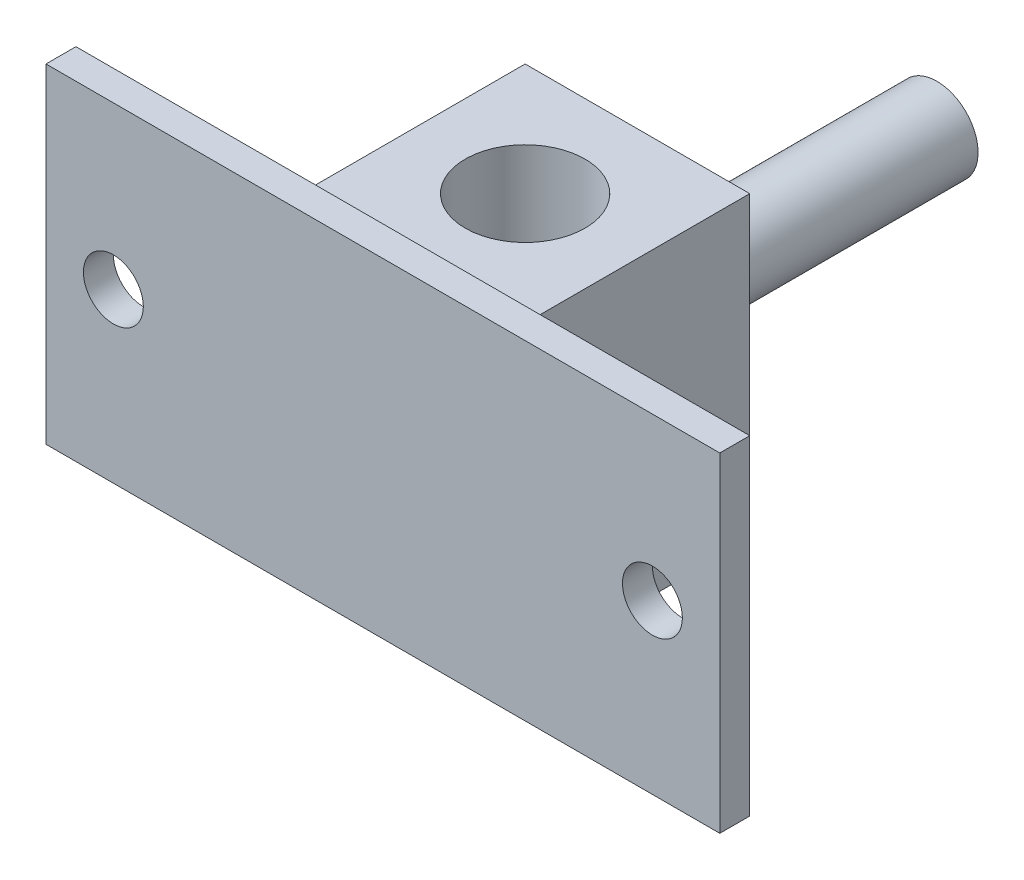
ISO-10303-21;
HEADER;
FILE_DESCRIPTION(('STEP AP214'),'2;1');
FILE_NAME('part.step','',(''),(''),'','','');
FILE_SCHEMA(('AUTOMOTIVE_DESIGN { 1 0 10303 214 1 1 1 1 }'));
ENDSEC;
DATA;
#1=APPLICATION_CONTEXT('core data for automotive mechanical design processes');
#2=APPLICATION_PROTOCOL_DEFINITION('international standard','automotive_design',2000,#1);
#3=PRODUCT_CONTEXT('',#1,'mechanical');
#4=PRODUCT('Part','Part','',(#3));
#5=PRODUCT_RELATED_PRODUCT_CATEGORY('part','',(#4));
#6=PRODUCT_DEFINITION_FORMATION('','',#4);
#7=PRODUCT_DEFINITION_CONTEXT('part definition',#1,'design');
#8=PRODUCT_DEFINITION('design','',#6,#7);
#9=PRODUCT_DEFINITION_SHAPE('','',#8);
#10=(LENGTH_UNIT() NAMED_UNIT(*) SI_UNIT(.MILLI.,.METRE.));
#11=(NAMED_UNIT(*) PLANE_ANGLE_UNIT() SI_UNIT($,.RADIAN.));
#12=(NAMED_UNIT(*) SI_UNIT($,.STERADIAN.) SOLID_ANGLE_UNIT());
#13=UNCERTAINTY_MEASURE_WITH_UNIT(LENGTH_MEASURE(1.E-05),#10,'distance_accuracy_value','');
#14=(GEOMETRIC_REPRESENTATION_CONTEXT(3) GLOBAL_UNCERTAINTY_ASSIGNED_CONTEXT((#13)) GLOBAL_UNIT_ASSIGNED_CONTEXT((#10,
#11,#12)) REPRESENTATION_CONTEXT('',''));
#15=CARTESIAN_POINT('',(0.,0.,0.));
#16=DIRECTION('',(0.,0.,1.));
#17=DIRECTION('',(1.,0.,0.));
#18=AXIS2_PLACEMENT_3D('',#15,#16,#17);
#19=CARTESIAN_POINT('',(0.,20.,0.));
#20=DIRECTION('',(0.,0.,-1.));
#21=DIRECTION('',(-1.,0.,0.));
#22=AXIS2_PLACEMENT_3D('',#19,#20,#21);
#23=PLANE('',#22);
#24=DIRECTION('',(0.,-1.,0.));
#25=VECTOR('',#24,1.);
#26=CARTESIAN_POINT('',(0.,0.,0.));
#27=LINE('',#26,#25);
#28=CARTESIAN_POINT('',(0.,20.,0.));
#29=VERTEX_POINT('',#28);
#30=CARTESIAN_POINT('',(0.,0.,0.));
#31=VERTEX_POINT('',#30);
#32=EDGE_CURVE('E140',#29,#31,#27,.T.);
#33=ORIENTED_EDGE('',*,*,#32,.F.);
#34=DIRECTION('',(-1.,0.,0.));
#35=VECTOR('',#34,1.);
#36=CARTESIAN_POINT('',(0.,20.,0.));
#37=LINE('',#36,#35);
#38=CARTESIAN_POINT('',(15.,20.,0.));
#39=VERTEX_POINT('',#38);
#40=EDGE_CURVE('E68',#39,#29,#37,.T.);
#41=ORIENTED_EDGE('',*,*,#40,.F.);
#42=DIRECTION('',(0.,1.,0.));
#43=VECTOR('',#42,1.);
#44=CARTESIAN_POINT('',(15.,0.,0.));
#45=LINE('',#44,#43);
#46=CARTESIAN_POINT('',(15.,0.,0.));
#47=VERTEX_POINT('',#46);
#48=EDGE_CURVE('E63',#47,#39,#45,.T.);
#49=ORIENTED_EDGE('',*,*,#48,.F.);
#50=DIRECTION('',(1.,0.,0.));
#51=VECTOR('',#50,1.);
#52=CARTESIAN_POINT('',(0.,0.,0.));
#53=LINE('',#52,#51);
#54=EDGE_CURVE('E154',#31,#47,#53,.T.);
#55=ORIENTED_EDGE('',*,*,#54,.F.);
#56=EDGE_LOOP('',(#33,#41,#49,#55));
#57=FACE_BOUND('',#56,.T.);
#58=CARTESIAN_POINT('',(7.5,10.,0.));
#59=DIRECTION('',(0.,0.,-1.));
#60=DIRECTION('',(-1.,0.,0.));
#61=AXIS2_PLACEMENT_3D('',#58,#59,#60);
#62=CIRCLE('',#61,2.75);
#63=CARTESIAN_POINT('',(4.75,10.,0.));
#64=VERTEX_POINT('',#63);
#65=EDGE_CURVE('E320',#64,#64,#62,.T.);
#66=ORIENTED_EDGE('',*,*,#65,.F.);
#67=EDGE_LOOP('',(#66));
#68=FACE_BOUND('',#67,.T.);
#69=ADVANCED_FACE('F30',(#57,#68),#23,.T.);
#70=CARTESIAN_POINT('',(0.,0.,15.));
#71=DIRECTION('',(1.,0.,0.));
#72=DIRECTION('',(0.,0.,-1.));
#73=AXIS2_PLACEMENT_3D('',#70,#71,#72);
#74=PLANE('',#73);
#75=ORIENTED_EDGE('',*,*,#32,.T.);
#76=DIRECTION('',(0.,0.,-1.));
#77=VECTOR('',#76,1.);
#78=CARTESIAN_POINT('',(0.,0.,15.));
#79=LINE('',#78,#77);
#80=CARTESIAN_POINT('',(0.,0.,15.));
#81=VERTEX_POINT('',#80);
#82=EDGE_CURVE('E11',#81,#31,#79,.T.);
#83=ORIENTED_EDGE('',*,*,#82,.F.);
#84=DIRECTION('',(0.,-1.,0.));
#85=VECTOR('',#84,1.);
#86=CARTESIAN_POINT('',(0.,0.,15.));
#87=LINE('',#86,#85);
#88=CARTESIAN_POINT('',(0.,20.,15.));
#89=VERTEX_POINT('',#88);
#90=EDGE_CURVE('E141',#89,#81,#87,.T.);
#91=ORIENTED_EDGE('',*,*,#90,.F.);
#92=DIRECTION('',(0.,0.,-1.));
#93=VECTOR('',#92,1.);
#94=CARTESIAN_POINT('',(0.,20.,15.));
#95=LINE('',#94,#93);
#96=EDGE_CURVE('E151',#89,#29,#95,.T.);
#97=ORIENTED_EDGE('',*,*,#96,.T.);
#98=EDGE_LOOP('',(#75,#83,#91,#97));
#99=FACE_BOUND('',#98,.T.);
#100=ADVANCED_FACE('F32',(#99),#74,.F.);
#101=CARTESIAN_POINT('',(0.,0.,15.));
#102=DIRECTION('',(0.,1.,0.));
#103=DIRECTION('',(0.,0.,1.));
#104=AXIS2_PLACEMENT_3D('',#101,#102,#103);
#105=PLANE('',#104);
#106=CARTESIAN_POINT('',(7.5,0.,7.5));
#107=DIRECTION('',(0.,1.,0.));
#108=DIRECTION('',(0.,0.,1.));
#109=AXIS2_PLACEMENT_3D('',#106,#107,#108);
#110=CIRCLE('',#109,4.);
#111=CARTESIAN_POINT('',(7.5,0.,11.5));
#112=VERTEX_POINT('',#111);
#113=EDGE_CURVE('E132',#112,#112,#110,.T.);
#114=ORIENTED_EDGE('',*,*,#113,.T.);
#115=EDGE_LOOP('',(#114));
#116=FACE_BOUND('',#115,.T.);
#117=ORIENTED_EDGE('',*,*,#54,.T.);
#118=DIRECTION('',(0.,0.,-1.));
#119=VECTOR('',#118,1.);
#120=CARTESIAN_POINT('',(15.,0.,15.));
#121=LINE('',#120,#119);
#122=CARTESIAN_POINT('',(15.,0.,15.));
#123=VERTEX_POINT('',#122);
#124=EDGE_CURVE('E39',#123,#47,#121,.T.);
#125=ORIENTED_EDGE('',*,*,#124,.F.);
#126=DIRECTION('',(1.,0.,0.));
#127=VECTOR('',#126,1.);
#128=CARTESIAN_POINT('',(0.,0.,15.));
#129=LINE('',#128,#127);
#130=EDGE_CURVE('E73',#81,#123,#129,.T.);
#131=ORIENTED_EDGE('',*,*,#130,.F.);
#132=ORIENTED_EDGE('',*,*,#82,.T.);
#133=EDGE_LOOP('',(#117,#125,#131,#132));
#134=FACE_BOUND('',#133,.T.);
#135=ADVANCED_FACE('F187',(#116,#134),#105,.F.);
#136=CARTESIAN_POINT('',(15.,0.,15.));
#137=DIRECTION('',(-1.,0.,0.));
#138=DIRECTION('',(0.,0.,1.));
#139=AXIS2_PLACEMENT_3D('',#136,#137,#138);
#140=PLANE('',#139);
#141=ORIENTED_EDGE('',*,*,#48,.T.);
#142=DIRECTION('',(0.,0.,-1.));
#143=VECTOR('',#142,1.);
#144=CARTESIAN_POINT('',(15.,20.,15.));
#145=LINE('',#144,#143);
#146=CARTESIAN_POINT('',(15.,20.,15.));
#147=VERTEX_POINT('',#146);
#148=EDGE_CURVE('E47',#147,#39,#145,.T.);
#149=ORIENTED_EDGE('',*,*,#148,.F.);
#150=DIRECTION('',(0.,1.,0.));
#151=VECTOR('',#150,1.);
#152=CARTESIAN_POINT('',(15.,0.,15.));
#153=LINE('',#152,#151);
#154=EDGE_CURVE('E145',#123,#147,#153,.T.);
#155=ORIENTED_EDGE('',*,*,#154,.F.);
#156=ORIENTED_EDGE('',*,*,#124,.T.);
#157=EDGE_LOOP('',(#141,#149,#155,#156));
#158=FACE_BOUND('',#157,.T.);
#159=ADVANCED_FACE('F159',(#158),#140,.F.);
#160=CARTESIAN_POINT('',(0.,20.,15.));
#161=DIRECTION('',(0.,-1.,0.));
#162=DIRECTION('',(0.,0.,-1.));
#163=AXIS2_PLACEMENT_3D('',#160,#161,#162);
#164=PLANE('',#163);
#165=CARTESIAN_POINT('',(7.5,20.,7.5));
#166=DIRECTION('',(0.,1.,0.));
#167=DIRECTION('',(0.,0.,1.));
#168=AXIS2_PLACEMENT_3D('',#165,#166,#167);
#169=CIRCLE('',#168,4.);
#170=CARTESIAN_POINT('',(7.5,20.,11.5));
#171=VERTEX_POINT('',#170);
#172=EDGE_CURVE('E129',#171,#171,#169,.T.);
#173=ORIENTED_EDGE('',*,*,#172,.F.);
#174=EDGE_LOOP('',(#173));
#175=FACE_BOUND('',#174,.T.);
#176=ORIENTED_EDGE('',*,*,#40,.T.);
#177=ORIENTED_EDGE('',*,*,#96,.F.);
#178=DIRECTION('',(-1.,0.,0.));
#179=VECTOR('',#178,1.);
#180=CARTESIAN_POINT('',(0.,20.,15.));
#181=LINE('',#180,#179);
#182=EDGE_CURVE('E148',#147,#89,#181,.T.);
#183=ORIENTED_EDGE('',*,*,#182,.F.);
#184=ORIENTED_EDGE('',*,*,#148,.T.);
#185=EDGE_LOOP('',(#176,#177,#183,#184));
#186=FACE_BOUND('',#185,.T.);
#187=ADVANCED_FACE('F164',(#175,#186),#164,.F.);
#188=CARTESIAN_POINT('',(7.5,-10.,7.5));
#189=DIRECTION('',(0.,1.,0.));
#190=DIRECTION('',(0.,0.,1.));
#191=AXIS2_PLACEMENT_3D('',#188,#189,#190);
#192=CYLINDRICAL_SURFACE('',#191,4.);
#193=ORIENTED_EDGE('',*,*,#172,.T.);
#194=EDGE_LOOP('',(#193));
#195=FACE_BOUND('',#194,.T.);
#196=ORIENTED_EDGE('',*,*,#113,.F.);
#197=EDGE_LOOP('',(#196));
#198=FACE_BOUND('',#197,.T.);
#199=ADVANCED_FACE('F168',(#195,#198),#192,.F.);
#200=CARTESIAN_POINT('',(-15.,-1.,15.));
#201=DIRECTION('',(0.,0.,1.));
#202=DIRECTION('',(1.,0.,0.));
#203=AXIS2_PLACEMENT_3D('',#200,#201,#202);
#204=PLANE('',#203);
#205=CARTESIAN_POINT('',(25.5,10.2120278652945,15.));
#206=DIRECTION('',(0.,0.,1.));
#207=DIRECTION('',(1.,0.,0.));
#208=AXIS2_PLACEMENT_3D('',#205,#206,#207);
#209=CIRCLE('',#208,2.);
#210=CARTESIAN_POINT('',(27.5,10.2120278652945,15.));
#211=VERTEX_POINT('',#210);
#212=EDGE_CURVE('E323',#211,#211,#209,.T.);
#213=ORIENTED_EDGE('',*,*,#212,.T.);
#214=EDGE_LOOP('',(#213));
#215=FACE_BOUND('',#214,.T.);
#216=CARTESIAN_POINT('',(-10.5,10.2120278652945,15.));
#217=DIRECTION('',(0.,0.,1.));
#218=DIRECTION('',(1.,0.,0.));
#219=AXIS2_PLACEMENT_3D('',#216,#217,#218);
#220=CIRCLE('',#219,2.);
#221=CARTESIAN_POINT('',(-8.5,10.2120278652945,15.));
#222=VERTEX_POINT('',#221);
#223=EDGE_CURVE('E330',#222,#222,#220,.T.);
#224=ORIENTED_EDGE('',*,*,#223,.T.);
#225=EDGE_LOOP('',(#224));
#226=FACE_BOUND('',#225,.T.);
#227=DIRECTION('',(0.,-1.,0.));
#228=VECTOR('',#227,1.);
#229=CARTESIAN_POINT('',(-15.,21.,15.));
#230=LINE('',#229,#228);
#231=CARTESIAN_POINT('',(-15.,21.,15.));
#232=VERTEX_POINT('',#231);
#233=CARTESIAN_POINT('',(-15.,-1.,15.));
#234=VERTEX_POINT('',#233);
#235=EDGE_CURVE('E128',#232,#234,#230,.T.);
#236=ORIENTED_EDGE('',*,*,#235,.F.);
#237=DIRECTION('',(-1.,0.,0.));
#238=VECTOR('',#237,1.);
#239=CARTESIAN_POINT('',(-15.,21.,15.));
#240=LINE('',#239,#238);
#241=CARTESIAN_POINT('',(30.,21.,15.));
#242=VERTEX_POINT('',#241);
#243=EDGE_CURVE('E124',#242,#232,#240,.T.);
#244=ORIENTED_EDGE('',*,*,#243,.F.);
#245=DIRECTION('',(0.,1.,0.));
#246=VECTOR('',#245,1.);
#247=CARTESIAN_POINT('',(30.,21.,15.));
#248=LINE('',#247,#246);
#249=CARTESIAN_POINT('',(30.,-1.,15.));
#250=VERTEX_POINT('',#249);
#251=EDGE_CURVE('E341',#250,#242,#248,.T.);
#252=ORIENTED_EDGE('',*,*,#251,.F.);
#253=DIRECTION('',(1.,0.,0.));
#254=VECTOR('',#253,1.);
#255=CARTESIAN_POINT('',(-15.,-1.,15.));
#256=LINE('',#255,#254);
#257=EDGE_CURVE('E339',#234,#250,#256,.T.);
#258=ORIENTED_EDGE('',*,*,#257,.F.);
#259=EDGE_LOOP('',(#236,#244,#252,#258));
#260=FACE_BOUND('',#259,.T.);
#261=ORIENTED_EDGE('',*,*,#182,.T.);
#262=ORIENTED_EDGE('',*,*,#90,.T.);
#263=ORIENTED_EDGE('',*,*,#130,.T.);
#264=ORIENTED_EDGE('',*,*,#154,.T.);
#265=EDGE_LOOP('',(#261,#262,#263,#264));
#266=FACE_BOUND('',#265,.T.);
#267=ADVANCED_FACE('F166',(#215,#226,#260,#266),#204,.F.);
#268=CARTESIAN_POINT('',(-15.,21.,17.));
#269=DIRECTION('',(1.,0.,0.));
#270=DIRECTION('',(0.,1.,0.));
#271=AXIS2_PLACEMENT_3D('',#268,#269,#270);
#272=PLANE('',#271);
#273=ORIENTED_EDGE('',*,*,#235,.T.);
#274=DIRECTION('',(0.,0.,-1.));
#275=VECTOR('',#274,1.);
#276=CARTESIAN_POINT('',(-15.,-1.,17.));
#277=LINE('',#276,#275);
#278=CARTESIAN_POINT('',(-15.,-1.,17.));
#279=VERTEX_POINT('',#278);
#280=EDGE_CURVE('E108',#279,#234,#277,.T.);
#281=ORIENTED_EDGE('',*,*,#280,.F.);
#282=DIRECTION('',(0.,-1.,0.));
#283=VECTOR('',#282,1.);
#284=CARTESIAN_POINT('',(-15.,21.,17.));
#285=LINE('',#284,#283);
#286=CARTESIAN_POINT('',(-15.,21.,17.));
#287=VERTEX_POINT('',#286);
#288=EDGE_CURVE('E115',#287,#279,#285,.T.);
#289=ORIENTED_EDGE('',*,*,#288,.F.);
#290=DIRECTION('',(0.,0.,-1.));
#291=VECTOR('',#290,1.);
#292=CARTESIAN_POINT('',(-15.,21.,17.));
#293=LINE('',#292,#291);
#294=EDGE_CURVE('E337',#287,#232,#293,.T.);
#295=ORIENTED_EDGE('',*,*,#294,.T.);
#296=EDGE_LOOP('',(#273,#281,#289,#295));
#297=FACE_BOUND('',#296,.T.);
#298=ADVANCED_FACE('F126',(#297),#272,.F.);
#299=CARTESIAN_POINT('',(-15.,-1.,17.));
#300=DIRECTION('',(0.,1.,0.));
#301=DIRECTION('',(0.,0.,1.));
#302=AXIS2_PLACEMENT_3D('',#299,#300,#301);
#303=PLANE('',#302);
#304=ORIENTED_EDGE('',*,*,#257,.T.);
#305=DIRECTION('',(0.,0.,-1.));
#306=VECTOR('',#305,1.);
#307=CARTESIAN_POINT('',(30.,-1.,17.));
#308=LINE('',#307,#306);
#309=CARTESIAN_POINT('',(30.,-1.,17.));
#310=VERTEX_POINT('',#309);
#311=EDGE_CURVE('E111',#310,#250,#308,.T.);
#312=ORIENTED_EDGE('',*,*,#311,.F.);
#313=DIRECTION('',(1.,0.,0.));
#314=VECTOR('',#313,1.);
#315=CARTESIAN_POINT('',(-15.,-1.,17.));
#316=LINE('',#315,#314);
#317=EDGE_CURVE('E104',#279,#310,#316,.T.);
#318=ORIENTED_EDGE('',*,*,#317,.F.);
#319=ORIENTED_EDGE('',*,*,#280,.T.);
#320=EDGE_LOOP('',(#304,#312,#318,#319));
#321=FACE_BOUND('',#320,.T.);
#322=ADVANCED_FACE('F106',(#321),#303,.F.);
#323=CARTESIAN_POINT('',(30.,21.,17.));
#324=DIRECTION('',(-1.,0.,0.));
#325=DIRECTION('',(0.,-1.,0.));
#326=AXIS2_PLACEMENT_3D('',#323,#324,#325);
#327=PLANE('',#326);
#328=ORIENTED_EDGE('',*,*,#251,.T.);
#329=DIRECTION('',(0.,0.,-1.));
#330=VECTOR('',#329,1.);
#331=CARTESIAN_POINT('',(30.,21.,17.));
#332=LINE('',#331,#330);
#333=CARTESIAN_POINT('',(30.,21.,17.));
#334=VERTEX_POINT('',#333);
#335=EDGE_CURVE('E134',#334,#242,#332,.T.);
#336=ORIENTED_EDGE('',*,*,#335,.F.);
#337=DIRECTION('',(0.,1.,0.));
#338=VECTOR('',#337,1.);
#339=CARTESIAN_POINT('',(30.,21.,17.));
#340=LINE('',#339,#338);
#341=EDGE_CURVE('E114',#310,#334,#340,.T.);
#342=ORIENTED_EDGE('',*,*,#341,.F.);
#343=ORIENTED_EDGE('',*,*,#311,.T.);
#344=EDGE_LOOP('',(#328,#336,#342,#343));
#345=FACE_BOUND('',#344,.T.);
#346=ADVANCED_FACE('F244',(#345),#327,.F.);
#347=CARTESIAN_POINT('',(-15.,21.,17.));
#348=DIRECTION('',(0.,-1.,0.));
#349=DIRECTION('',(0.,0.,-1.));
#350=AXIS2_PLACEMENT_3D('',#347,#348,#349);
#351=PLANE('',#350);
#352=ORIENTED_EDGE('',*,*,#243,.T.);
#353=ORIENTED_EDGE('',*,*,#294,.F.);
#354=DIRECTION('',(-1.,0.,0.));
#355=VECTOR('',#354,1.);
#356=CARTESIAN_POINT('',(-15.,21.,17.));
#357=LINE('',#356,#355);
#358=EDGE_CURVE('E120',#334,#287,#357,.T.);
#359=ORIENTED_EDGE('',*,*,#358,.F.);
#360=ORIENTED_EDGE('',*,*,#335,.T.);
#361=EDGE_LOOP('',(#352,#353,#359,#360));
#362=FACE_BOUND('',#361,.T.);
#363=ADVANCED_FACE('F252',(#362),#351,.F.);
#364=CARTESIAN_POINT('',(-15.,-1.,17.));
#365=DIRECTION('',(0.,0.,1.));
#366=DIRECTION('',(1.,0.,0.));
#367=AXIS2_PLACEMENT_3D('',#364,#365,#366);
#368=PLANE('',#367);
#369=CARTESIAN_POINT('',(25.5,10.2120278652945,17.));
#370=DIRECTION('',(0.,0.,1.));
#371=DIRECTION('',(1.,0.,0.));
#372=AXIS2_PLACEMENT_3D('',#369,#370,#371);
#373=CIRCLE('',#372,2.);
#374=CARTESIAN_POINT('',(27.5,10.2120278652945,17.));
#375=VERTEX_POINT('',#374);
#376=EDGE_CURVE('E319',#375,#375,#373,.T.);
#377=ORIENTED_EDGE('',*,*,#376,.F.);
#378=EDGE_LOOP('',(#377));
#379=FACE_BOUND('',#378,.T.);
#380=CARTESIAN_POINT('',(-10.5,10.2120278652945,17.));
#381=DIRECTION('',(0.,0.,1.));
#382=DIRECTION('',(1.,0.,0.));
#383=AXIS2_PLACEMENT_3D('',#380,#381,#382);
#384=CIRCLE('',#383,2.);
#385=CARTESIAN_POINT('',(-8.5,10.2120278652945,17.));
#386=VERTEX_POINT('',#385);
#387=EDGE_CURVE('E328',#386,#386,#384,.T.);
#388=ORIENTED_EDGE('',*,*,#387,.F.);
#389=EDGE_LOOP('',(#388));
#390=FACE_BOUND('',#389,.T.);
#391=ORIENTED_EDGE('',*,*,#288,.T.);
#392=ORIENTED_EDGE('',*,*,#317,.T.);
#393=ORIENTED_EDGE('',*,*,#341,.T.);
#394=ORIENTED_EDGE('',*,*,#358,.T.);
#395=EDGE_LOOP('',(#391,#392,#393,#394));
#396=FACE_BOUND('',#395,.T.);
#397=ADVANCED_FACE('F118',(#379,#390,#396),#368,.T.);
#398=CARTESIAN_POINT('',(-10.5,10.2120278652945,15.));
#399=DIRECTION('',(0.,0.,1.));
#400=DIRECTION('',(1.,0.,0.));
#401=AXIS2_PLACEMENT_3D('',#398,#399,#400);
#402=CYLINDRICAL_SURFACE('',#401,2.);
#403=ORIENTED_EDGE('',*,*,#223,.F.);
#404=EDGE_LOOP('',(#403));
#405=FACE_BOUND('',#404,.T.);
#406=ORIENTED_EDGE('',*,*,#387,.T.);
#407=EDGE_LOOP('',(#406));
#408=FACE_BOUND('',#407,.T.);
#409=ADVANCED_FACE('F266',(#405,#408),#402,.F.);
#410=CARTESIAN_POINT('',(25.5,10.2120278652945,15.));
#411=DIRECTION('',(0.,0.,1.));
#412=DIRECTION('',(1.,0.,0.));
#413=AXIS2_PLACEMENT_3D('',#410,#411,#412);
#414=CYLINDRICAL_SURFACE('',#413,2.);
#415=ORIENTED_EDGE('',*,*,#212,.F.);
#416=EDGE_LOOP('',(#415));
#417=FACE_BOUND('',#416,.T.);
#418=ORIENTED_EDGE('',*,*,#376,.T.);
#419=EDGE_LOOP('',(#418));
#420=FACE_BOUND('',#419,.T.);
#421=ADVANCED_FACE('F274',(#417,#420),#414,.F.);
#422=CARTESIAN_POINT('',(7.5,10.,-20.));
#423=DIRECTION('',(0.,0.,1.));
#424=DIRECTION('',(1.,0.,0.));
#425=AXIS2_PLACEMENT_3D('',#422,#423,#424);
#426=CYLINDRICAL_SURFACE('',#425,2.75);
#427=CARTESIAN_POINT('',(7.5,10.,-20.));
#428=DIRECTION('',(0.,0.,-1.));
#429=DIRECTION('',(-1.,0.,0.));
#430=AXIS2_PLACEMENT_3D('',#427,#428,#429);
#431=CIRCLE('',#430,2.75);
#432=CARTESIAN_POINT('',(4.75,10.,-20.));
#433=VERTEX_POINT('',#432);
#434=EDGE_CURVE('E318',#433,#433,#431,.T.);
#435=ORIENTED_EDGE('',*,*,#434,.F.);
#436=EDGE_LOOP('',(#435));
#437=FACE_BOUND('',#436,.T.);
#438=ORIENTED_EDGE('',*,*,#65,.T.);
#439=EDGE_LOOP('',(#438));
#440=FACE_BOUND('',#439,.T.);
#441=ADVANCED_FACE('F283',(#437,#440),#426,.T.);
#442=CARTESIAN_POINT('',(7.5,10.,-20.));
#443=DIRECTION('',(0.,0.,-1.));
#444=DIRECTION('',(-1.,0.,0.));
#445=AXIS2_PLACEMENT_3D('',#442,#443,#444);
#446=PLANE('',#445);
#447=ORIENTED_EDGE('',*,*,#434,.T.);
#448=EDGE_LOOP('',(#447));
#449=FACE_BOUND('',#448,.T.);
#450=ADVANCED_FACE('F296',(#449),#446,.T.);
#451=CLOSED_SHELL('',(#69,#100,#135,#159,#187,#199,#267,#298,#322,#346,#363,#397,#409,#421,#441,#450));
#452=MANIFOLD_SOLID_BREP('B2',#451);
#453=ADVANCED_BREP_SHAPE_REPRESENTATION('',(#18,#452),#14);
#454=SHAPE_DEFINITION_REPRESENTATION(#9,#453);
ENDSEC;
END-ISO-10303-21;
